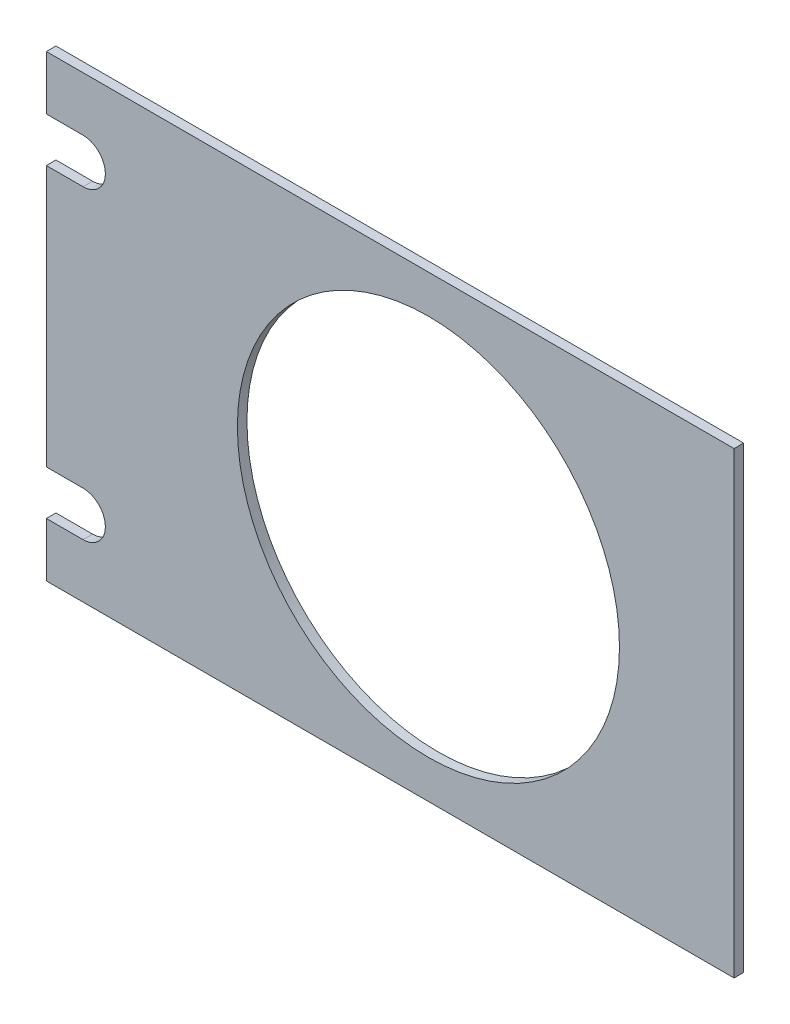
from build123d import *

# Parameters (mm, degrees)
SKETCH1_R      = 7.9375
EXTRUDE1_DEPTH = 0.1984375


with BuildPart() as part:
    # Sketch1 → Extrude1 (new, symmetric)
    with BuildSketch(Plane.XY):
        with BuildLine():
            Line((0, -9.525), (28.575, -9.525))
            Line((28.575, -9.525), (28.575, 9.525))
            Line((28.575, 9.525), (0, 9.525))
            Line((0, 9.525), (0, 7.2771))
            Line((0, 7.2771), (1.524, 7.2771))
            ThreePointArc((1.524, 7.2771), (2.4511, 6.35), (1.524, 5.4229))
            Line((1.524, 5.4229), (0, 5.4229))
            Line((0, 5.4229), (0, -5.4229))
            Line((0, -5.4229), (1.524, -5.4229))
            ThreePointArc((1.524, -5.4229), (2.4511, -6.35), (1.524, -7.2771))
            Line((1.524, -7.2771), (0, -7.2771))
            Line((0, -7.2771), (0, -9.525))
        make_face()
        with Locations((15.875, 0)):
            Circle(SKETCH1_R, mode=Mode.SUBTRACT)
    extrude(amount=EXTRUDE1_DEPTH, both=True)


solid = part.part
